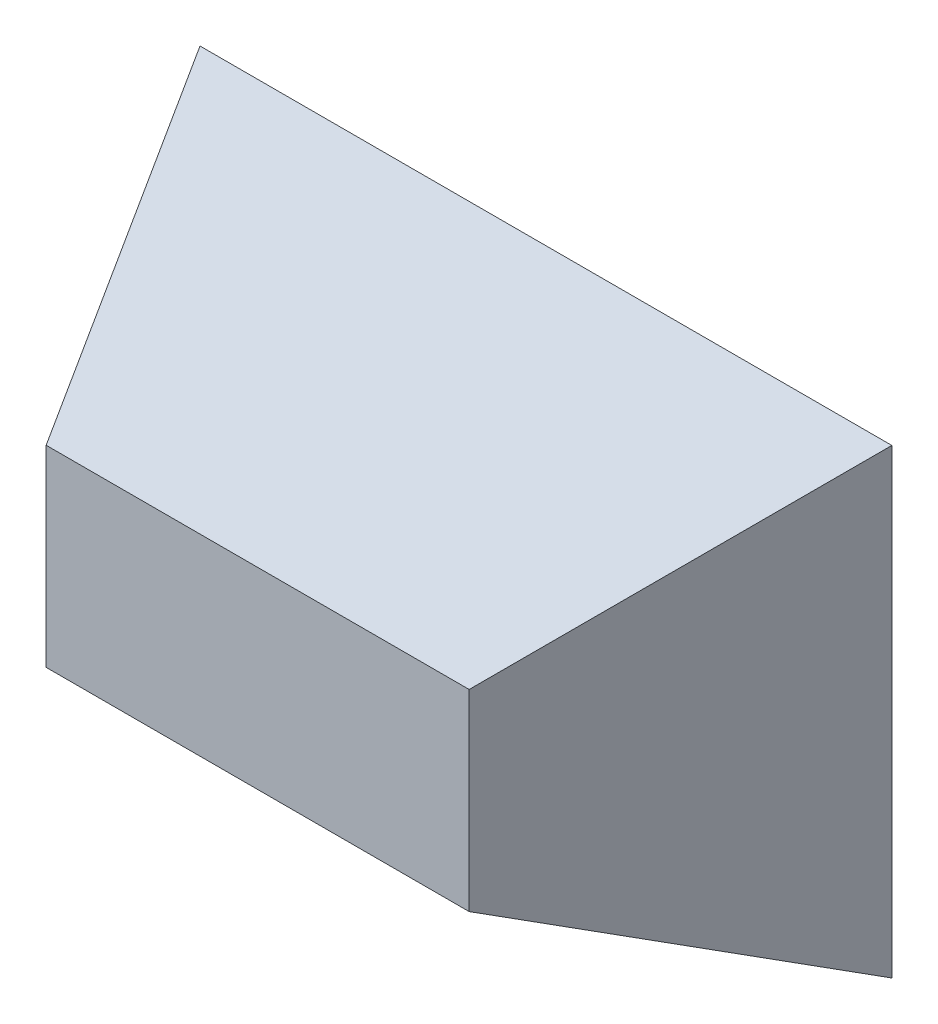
ISO-10303-21;
HEADER;
FILE_DESCRIPTION(('STEP AP214'),'2;1');
FILE_NAME('part.step','',(''),(''),'','','');
FILE_SCHEMA(('AUTOMOTIVE_DESIGN { 1 0 10303 214 1 1 1 1 }'));
ENDSEC;
DATA;
#1=APPLICATION_CONTEXT('core data for automotive mechanical design processes');
#2=APPLICATION_PROTOCOL_DEFINITION('international standard','automotive_design',2000,#1);
#3=PRODUCT_CONTEXT('',#1,'mechanical');
#4=PRODUCT('Part','Part','',(#3));
#5=PRODUCT_RELATED_PRODUCT_CATEGORY('part','',(#4));
#6=PRODUCT_DEFINITION_FORMATION('','',#4);
#7=PRODUCT_DEFINITION_CONTEXT('part definition',#1,'design');
#8=PRODUCT_DEFINITION('design','',#6,#7);
#9=PRODUCT_DEFINITION_SHAPE('','',#8);
#10=(LENGTH_UNIT() NAMED_UNIT(*) SI_UNIT(.MILLI.,.METRE.));
#11=(NAMED_UNIT(*) PLANE_ANGLE_UNIT() SI_UNIT($,.RADIAN.));
#12=(NAMED_UNIT(*) SI_UNIT($,.STERADIAN.) SOLID_ANGLE_UNIT());
#13=UNCERTAINTY_MEASURE_WITH_UNIT(LENGTH_MEASURE(1.E-05),#10,'distance_accuracy_value','');
#14=(GEOMETRIC_REPRESENTATION_CONTEXT(3) GLOBAL_UNCERTAINTY_ASSIGNED_CONTEXT((#13)) GLOBAL_UNIT_ASSIGNED_CONTEXT((#10,
#11,#12)) REPRESENTATION_CONTEXT('',''));
#15=CARTESIAN_POINT('',(0.,0.,0.));
#16=DIRECTION('',(0.,0.,1.));
#17=DIRECTION('',(1.,0.,0.));
#18=AXIS2_PLACEMENT_3D('',#15,#16,#17);
#19=CARTESIAN_POINT('',(-60.,40.,0.));
#20=DIRECTION('',(-0.90630778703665,0.,0.4226182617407));
#21=DIRECTION('',(0.4226182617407,0.,0.90630778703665));
#22=AXIS2_PLACEMENT_3D('',#19,#20,#21);
#23=PLANE('',#22);
#24=DIRECTION('',(0.,-1.,0.));
#25=VECTOR('',#24,1.);
#26=CARTESIAN_POINT('',(-60.,40.,0.));
#27=LINE('',#26,#25);
#28=CARTESIAN_POINT('',(-60.,40.,0.));
#29=VERTEX_POINT('',#28);
#30=CARTESIAN_POINT('',(-60.,-40.,0.));
#31=VERTEX_POINT('',#30);
#32=EDGE_CURVE('E77',#29,#31,#27,.T.);
#33=ORIENTED_EDGE('',*,*,#32,.T.);
#34=DIRECTION('',(-0.389281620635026,-0.389281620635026,-0.834817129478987));
#35=VECTOR('',#34,1.);
#36=CARTESIAN_POINT('',(-60.,-40.,0.));
#37=LINE('',#36,#35);
#38=CARTESIAN_POINT('',(-36.68461709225,-16.68461709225,50.));
#39=VERTEX_POINT('',#38);
#40=EDGE_CURVE('E11',#39,#31,#37,.T.);
#41=ORIENTED_EDGE('',*,*,#40,.F.);
#42=DIRECTION('',(0.,1.,0.));
#43=VECTOR('',#42,1.);
#44=CARTESIAN_POINT('',(-36.68461709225,40.,50.));
#45=LINE('',#44,#43);
#46=CARTESIAN_POINT('',(-36.68461709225,16.68461709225,50.));
#47=VERTEX_POINT('',#46);
#48=EDGE_CURVE('E93',#47,#39,#45,.F.);
#49=ORIENTED_EDGE('',*,*,#48,.F.);
#50=DIRECTION('',(-0.389281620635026,0.389281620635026,-0.834817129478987));
#51=VECTOR('',#50,1.);
#52=CARTESIAN_POINT('',(-60.,40.,0.));
#53=LINE('',#52,#51);
#54=EDGE_CURVE('E88',#47,#29,#53,.T.);
#55=ORIENTED_EDGE('',*,*,#54,.T.);
#56=EDGE_LOOP('',(#33,#41,#49,#55));
#57=FACE_BOUND('',#56,.T.);
#58=ADVANCED_FACE('F31',(#57),#23,.T.);
#59=CARTESIAN_POINT('',(-60.,-40.,0.));
#60=DIRECTION('',(0.,-0.90630778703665,0.4226182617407));
#61=DIRECTION('',(0.,-0.4226182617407,-0.90630778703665));
#62=AXIS2_PLACEMENT_3D('',#59,#60,#61);
#63=PLANE('',#62);
#64=DIRECTION('',(1.,0.,0.));
#65=VECTOR('',#64,1.);
#66=CARTESIAN_POINT('',(-60.,-40.,0.));
#67=LINE('',#66,#65);
#68=CARTESIAN_POINT('',(60.,-40.,0.));
#69=VERTEX_POINT('',#68);
#70=EDGE_CURVE('E73',#31,#69,#67,.T.);
#71=ORIENTED_EDGE('',*,*,#70,.T.);
#72=DIRECTION('',(0.389281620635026,-0.389281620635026,-0.834817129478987));
#73=VECTOR('',#72,1.);
#74=CARTESIAN_POINT('',(47.8767855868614,-27.8767855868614,25.9983172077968));
#75=LINE('',#74,#73);
#76=CARTESIAN_POINT('',(36.68461709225,-16.68461709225,50.));
#77=VERTEX_POINT('',#76);
#78=EDGE_CURVE('E40',#77,#69,#75,.T.);
#79=ORIENTED_EDGE('',*,*,#78,.F.);
#80=DIRECTION('',(-1.,0.,0.));
#81=VECTOR('',#80,1.);
#82=CARTESIAN_POINT('',(-60.,-16.68461709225,50.));
#83=LINE('',#82,#81);
#84=EDGE_CURVE('E84',#39,#77,#83,.F.);
#85=ORIENTED_EDGE('',*,*,#84,.F.);
#86=ORIENTED_EDGE('',*,*,#40,.T.);
#87=EDGE_LOOP('',(#71,#79,#85,#86));
#88=FACE_BOUND('',#87,.T.);
#89=ADVANCED_FACE('F33',(#88),#63,.T.);
#90=CARTESIAN_POINT('',(60.,40.,0.));
#91=DIRECTION('',(0.90630778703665,0.,0.4226182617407));
#92=DIRECTION('',(0.4226182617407,0.,-0.90630778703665));
#93=AXIS2_PLACEMENT_3D('',#90,#91,#92);
#94=PLANE('',#93);
#95=DIRECTION('',(0.,1.,0.));
#96=VECTOR('',#95,1.);
#97=CARTESIAN_POINT('',(60.,40.,0.));
#98=LINE('',#97,#96);
#99=CARTESIAN_POINT('',(60.,40.,0.));
#100=VERTEX_POINT('',#99);
#101=EDGE_CURVE('E78',#69,#100,#98,.T.);
#102=ORIENTED_EDGE('',*,*,#101,.T.);
#103=DIRECTION('',(0.389281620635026,0.389281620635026,-0.834817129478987));
#104=VECTOR('',#103,1.);
#105=CARTESIAN_POINT('',(41.8151783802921,21.8151783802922,38.9974758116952));
#106=LINE('',#105,#104);
#107=CARTESIAN_POINT('',(36.68461709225,16.68461709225,50.));
#108=VERTEX_POINT('',#107);
#109=EDGE_CURVE('E96',#108,#100,#106,.T.);
#110=ORIENTED_EDGE('',*,*,#109,.F.);
#111=DIRECTION('',(0.,-1.,0.));
#112=VECTOR('',#111,1.);
#113=CARTESIAN_POINT('',(36.68461709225,40.,50.));
#114=LINE('',#113,#112);
#115=EDGE_CURVE('E52',#77,#108,#114,.F.);
#116=ORIENTED_EDGE('',*,*,#115,.F.);
#117=ORIENTED_EDGE('',*,*,#78,.T.);
#118=EDGE_LOOP('',(#102,#110,#116,#117));
#119=FACE_BOUND('',#118,.T.);
#120=ADVANCED_FACE('F103',(#119),#94,.T.);
#121=CARTESIAN_POINT('',(-60.,40.,0.));
#122=DIRECTION('',(0.,0.90630778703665,0.4226182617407));
#123=DIRECTION('',(0.,-0.4226182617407,0.90630778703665));
#124=AXIS2_PLACEMENT_3D('',#121,#122,#123);
#125=PLANE('',#124);
#126=DIRECTION('',(-1.,0.,0.));
#127=VECTOR('',#126,1.);
#128=CARTESIAN_POINT('',(-60.,40.,0.));
#129=LINE('',#128,#127);
#130=EDGE_CURVE('E92',#100,#29,#129,.T.);
#131=ORIENTED_EDGE('',*,*,#130,.T.);
#132=ORIENTED_EDGE('',*,*,#54,.F.);
#133=DIRECTION('',(1.,0.,0.));
#134=VECTOR('',#133,1.);
#135=CARTESIAN_POINT('',(-60.,16.68461709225,50.));
#136=LINE('',#135,#134);
#137=EDGE_CURVE('E35',#108,#47,#136,.F.);
#138=ORIENTED_EDGE('',*,*,#137,.F.);
#139=ORIENTED_EDGE('',*,*,#109,.T.);
#140=EDGE_LOOP('',(#131,#132,#138,#139));
#141=FACE_BOUND('',#140,.T.);
#142=ADVANCED_FACE('F105',(#141),#125,.T.);
#143=CARTESIAN_POINT('',(-60.,-40.,50.));
#144=DIRECTION('',(0.,0.,1.));
#145=DIRECTION('',(1.,0.,0.));
#146=AXIS2_PLACEMENT_3D('',#143,#144,#145);
#147=PLANE('',#146);
#148=ORIENTED_EDGE('',*,*,#48,.T.);
#149=ORIENTED_EDGE('',*,*,#84,.T.);
#150=ORIENTED_EDGE('',*,*,#115,.T.);
#151=ORIENTED_EDGE('',*,*,#137,.T.);
#152=EDGE_LOOP('',(#148,#149,#150,#151));
#153=FACE_BOUND('',#152,.T.);
#154=ADVANCED_FACE('F101',(#153),#147,.T.);
#155=CARTESIAN_POINT('',(-60.,-40.,0.));
#156=DIRECTION('',(0.,0.,1.));
#157=DIRECTION('',(1.,0.,0.));
#158=AXIS2_PLACEMENT_3D('',#155,#156,#157);
#159=PLANE('',#158);
#160=ORIENTED_EDGE('',*,*,#32,.F.);
#161=ORIENTED_EDGE('',*,*,#130,.F.);
#162=ORIENTED_EDGE('',*,*,#101,.F.);
#163=ORIENTED_EDGE('',*,*,#70,.F.);
#164=EDGE_LOOP('',(#160,#161,#162,#163));
#165=FACE_BOUND('',#164,.T.);
#166=ADVANCED_FACE('F74',(#165),#159,.F.);
#167=CLOSED_SHELL('',(#58,#89,#120,#142,#154,#166));
#168=MANIFOLD_SOLID_BREP('B2',#167);
#169=ADVANCED_BREP_SHAPE_REPRESENTATION('',(#18,#168),#14);
#170=SHAPE_DEFINITION_REPRESENTATION(#9,#169);
ENDSEC;
END-ISO-10303-21;
